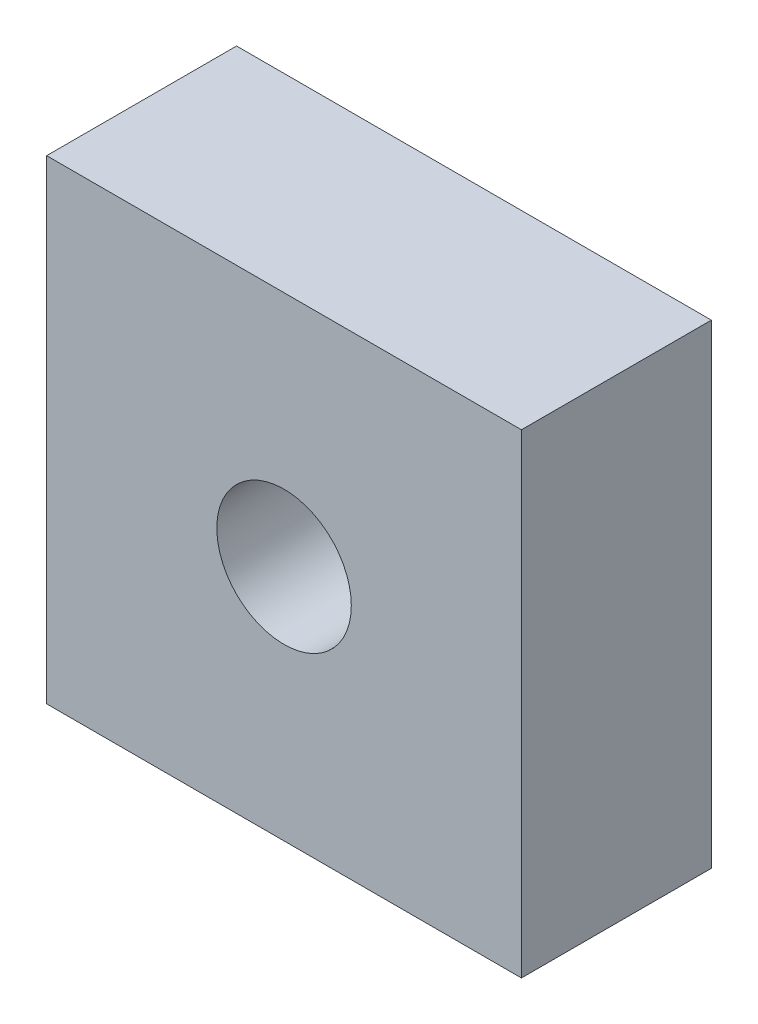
ISO-10303-21;
HEADER;
FILE_DESCRIPTION(('STEP AP214'),'2;1');
FILE_NAME('part.step','',(''),(''),'','','');
FILE_SCHEMA(('AUTOMOTIVE_DESIGN { 1 0 10303 214 1 1 1 1 }'));
ENDSEC;
DATA;
#1=APPLICATION_CONTEXT('core data for automotive mechanical design processes');
#2=APPLICATION_PROTOCOL_DEFINITION('international standard','automotive_design',2000,#1);
#3=PRODUCT_CONTEXT('',#1,'mechanical');
#4=PRODUCT('Part','Part','',(#3));
#5=PRODUCT_RELATED_PRODUCT_CATEGORY('part','',(#4));
#6=PRODUCT_DEFINITION_FORMATION('','',#4);
#7=PRODUCT_DEFINITION_CONTEXT('part definition',#1,'design');
#8=PRODUCT_DEFINITION('design','',#6,#7);
#9=PRODUCT_DEFINITION_SHAPE('','',#8);
#10=(LENGTH_UNIT() NAMED_UNIT(*) SI_UNIT(.MILLI.,.METRE.));
#11=(NAMED_UNIT(*) PLANE_ANGLE_UNIT() SI_UNIT($,.RADIAN.));
#12=(NAMED_UNIT(*) SI_UNIT($,.STERADIAN.) SOLID_ANGLE_UNIT());
#13=UNCERTAINTY_MEASURE_WITH_UNIT(LENGTH_MEASURE(1.E-05),#10,'distance_accuracy_value','');
#14=(GEOMETRIC_REPRESENTATION_CONTEXT(3) GLOBAL_UNCERTAINTY_ASSIGNED_CONTEXT((#13)) GLOBAL_UNIT_ASSIGNED_CONTEXT((#10,
#11,#12)) REPRESENTATION_CONTEXT('',''));
#15=CARTESIAN_POINT('',(0.,0.,0.));
#16=DIRECTION('',(0.,0.,1.));
#17=DIRECTION('',(1.,0.,0.));
#18=AXIS2_PLACEMENT_3D('',#15,#16,#17);
#19=CARTESIAN_POINT('',(0.,-30.,12.));
#20=DIRECTION('',(0.,0.,1.));
#21=DIRECTION('',(1.,0.,0.));
#22=AXIS2_PLACEMENT_3D('',#19,#20,#21);
#23=PLANE('',#22);
#24=DIRECTION('',(0.,-1.,0.));
#25=VECTOR('',#24,1.);
#26=CARTESIAN_POINT('',(0.,0.,12.));
#27=LINE('',#26,#25);
#28=CARTESIAN_POINT('',(0.,0.,12.));
#29=VERTEX_POINT('',#28);
#30=CARTESIAN_POINT('',(0.,-30.,12.));
#31=VERTEX_POINT('',#30);
#32=EDGE_CURVE('E98',#29,#31,#27,.T.);
#33=ORIENTED_EDGE('',*,*,#32,.T.);
#34=DIRECTION('',(1.,0.,0.));
#35=VECTOR('',#34,1.);
#36=CARTESIAN_POINT('',(0.,-30.,12.));
#37=LINE('',#36,#35);
#38=CARTESIAN_POINT('',(30.,-30.,12.));
#39=VERTEX_POINT('',#38);
#40=EDGE_CURVE('E83',#31,#39,#37,.T.);
#41=ORIENTED_EDGE('',*,*,#40,.T.);
#42=DIRECTION('',(0.,1.,0.));
#43=VECTOR('',#42,1.);
#44=CARTESIAN_POINT('',(30.,0.,12.));
#45=LINE('',#44,#43);
#46=CARTESIAN_POINT('',(30.,0.,12.));
#47=VERTEX_POINT('',#46);
#48=EDGE_CURVE('E49',#39,#47,#45,.T.);
#49=ORIENTED_EDGE('',*,*,#48,.T.);
#50=DIRECTION('',(-1.,0.,0.));
#51=VECTOR('',#50,1.);
#52=CARTESIAN_POINT('',(0.,0.,12.));
#53=LINE('',#52,#51);
#54=EDGE_CURVE('E44',#47,#29,#53,.T.);
#55=ORIENTED_EDGE('',*,*,#54,.T.);
#56=EDGE_LOOP('',(#33,#41,#49,#55));
#57=FACE_BOUND('',#56,.T.);
#58=CARTESIAN_POINT('',(15.,-15.,12.));
#59=DIRECTION('',(0.,0.,1.));
#60=DIRECTION('',(1.,0.,0.));
#61=AXIS2_PLACEMENT_3D('',#58,#59,#60);
#62=CIRCLE('',#61,4.25);
#63=CARTESIAN_POINT('',(19.25,-15.,12.));
#64=VERTEX_POINT('',#63);
#65=EDGE_CURVE('E88',#64,#64,#62,.T.);
#66=ORIENTED_EDGE('',*,*,#65,.F.);
#67=EDGE_LOOP('',(#66));
#68=FACE_BOUND('',#67,.T.);
#69=ADVANCED_FACE('F29',(#57,#68),#23,.T.);
#70=CARTESIAN_POINT('',(0.,-30.,0.));
#71=DIRECTION('',(0.,0.,1.));
#72=DIRECTION('',(1.,0.,0.));
#73=AXIS2_PLACEMENT_3D('',#70,#71,#72);
#74=PLANE('',#73);
#75=DIRECTION('',(0.,-1.,0.));
#76=VECTOR('',#75,1.);
#77=CARTESIAN_POINT('',(0.,0.,0.));
#78=LINE('',#77,#76);
#79=CARTESIAN_POINT('',(0.,0.,0.));
#80=VERTEX_POINT('',#79);
#81=CARTESIAN_POINT('',(0.,-30.,0.));
#82=VERTEX_POINT('',#81);
#83=EDGE_CURVE('E75',#80,#82,#78,.T.);
#84=ORIENTED_EDGE('',*,*,#83,.F.);
#85=DIRECTION('',(-1.,0.,0.));
#86=VECTOR('',#85,1.);
#87=CARTESIAN_POINT('',(0.,0.,0.));
#88=LINE('',#87,#86);
#89=CARTESIAN_POINT('',(30.,0.,0.));
#90=VERTEX_POINT('',#89);
#91=EDGE_CURVE('E96',#90,#80,#88,.T.);
#92=ORIENTED_EDGE('',*,*,#91,.F.);
#93=DIRECTION('',(0.,1.,0.));
#94=VECTOR('',#93,1.);
#95=CARTESIAN_POINT('',(30.,0.,0.));
#96=LINE('',#95,#94);
#97=CARTESIAN_POINT('',(30.,-30.,0.));
#98=VERTEX_POINT('',#97);
#99=EDGE_CURVE('E76',#98,#90,#96,.T.);
#100=ORIENTED_EDGE('',*,*,#99,.F.);
#101=DIRECTION('',(1.,0.,0.));
#102=VECTOR('',#101,1.);
#103=CARTESIAN_POINT('',(0.,-30.,0.));
#104=LINE('',#103,#102);
#105=EDGE_CURVE('E70',#82,#98,#104,.T.);
#106=ORIENTED_EDGE('',*,*,#105,.F.);
#107=EDGE_LOOP('',(#84,#92,#100,#106));
#108=FACE_BOUND('',#107,.T.);
#109=CARTESIAN_POINT('',(15.,-15.,0.));
#110=DIRECTION('',(0.,0.,1.));
#111=DIRECTION('',(1.,0.,0.));
#112=AXIS2_PLACEMENT_3D('',#109,#110,#111);
#113=CIRCLE('',#112,4.25);
#114=CARTESIAN_POINT('',(19.25,-15.,0.));
#115=VERTEX_POINT('',#114);
#116=EDGE_CURVE('E91',#115,#115,#113,.T.);
#117=ORIENTED_EDGE('',*,*,#116,.T.);
#118=EDGE_LOOP('',(#117));
#119=FACE_BOUND('',#118,.T.);
#120=ADVANCED_FACE('F71',(#108,#119),#74,.F.);
#121=CARTESIAN_POINT('',(0.,0.,12.));
#122=DIRECTION('',(1.,0.,0.));
#123=DIRECTION('',(0.,1.,0.));
#124=AXIS2_PLACEMENT_3D('',#121,#122,#123);
#125=PLANE('',#124);
#126=ORIENTED_EDGE('',*,*,#83,.T.);
#127=DIRECTION('',(0.,0.,-1.));
#128=VECTOR('',#127,1.);
#129=CARTESIAN_POINT('',(0.,-30.,12.));
#130=LINE('',#129,#128);
#131=EDGE_CURVE('E11',#31,#82,#130,.T.);
#132=ORIENTED_EDGE('',*,*,#131,.F.);
#133=ORIENTED_EDGE('',*,*,#32,.F.);
#134=DIRECTION('',(0.,0.,-1.));
#135=VECTOR('',#134,1.);
#136=CARTESIAN_POINT('',(0.,0.,12.));
#137=LINE('',#136,#135);
#138=EDGE_CURVE('E87',#29,#80,#137,.T.);
#139=ORIENTED_EDGE('',*,*,#138,.T.);
#140=EDGE_LOOP('',(#126,#132,#133,#139));
#141=FACE_BOUND('',#140,.T.);
#142=ADVANCED_FACE('F31',(#141),#125,.F.);
#143=CARTESIAN_POINT('',(0.,-30.,12.));
#144=DIRECTION('',(0.,1.,0.));
#145=DIRECTION('',(0.,0.,1.));
#146=AXIS2_PLACEMENT_3D('',#143,#144,#145);
#147=PLANE('',#146);
#148=ORIENTED_EDGE('',*,*,#105,.T.);
#149=DIRECTION('',(0.,0.,-1.));
#150=VECTOR('',#149,1.);
#151=CARTESIAN_POINT('',(30.,-30.,12.));
#152=LINE('',#151,#150);
#153=EDGE_CURVE('E37',#39,#98,#152,.T.);
#154=ORIENTED_EDGE('',*,*,#153,.F.);
#155=ORIENTED_EDGE('',*,*,#40,.F.);
#156=ORIENTED_EDGE('',*,*,#131,.T.);
#157=EDGE_LOOP('',(#148,#154,#155,#156));
#158=FACE_BOUND('',#157,.T.);
#159=ADVANCED_FACE('F82',(#158),#147,.F.);
#160=CARTESIAN_POINT('',(30.,0.,12.));
#161=DIRECTION('',(-1.,0.,0.));
#162=DIRECTION('',(0.,-1.,0.));
#163=AXIS2_PLACEMENT_3D('',#160,#161,#162);
#164=PLANE('',#163);
#165=ORIENTED_EDGE('',*,*,#99,.T.);
#166=DIRECTION('',(0.,0.,-1.));
#167=VECTOR('',#166,1.);
#168=CARTESIAN_POINT('',(30.,0.,12.));
#169=LINE('',#168,#167);
#170=EDGE_CURVE('E104',#47,#90,#169,.T.);
#171=ORIENTED_EDGE('',*,*,#170,.F.);
#172=ORIENTED_EDGE('',*,*,#48,.F.);
#173=ORIENTED_EDGE('',*,*,#153,.T.);
#174=EDGE_LOOP('',(#165,#171,#172,#173));
#175=FACE_BOUND('',#174,.T.);
#176=ADVANCED_FACE('F107',(#175),#164,.F.);
#177=CARTESIAN_POINT('',(0.,0.,12.));
#178=DIRECTION('',(0.,-1.,0.));
#179=DIRECTION('',(0.,0.,-1.));
#180=AXIS2_PLACEMENT_3D('',#177,#178,#179);
#181=PLANE('',#180);
#182=ORIENTED_EDGE('',*,*,#91,.T.);
#183=ORIENTED_EDGE('',*,*,#138,.F.);
#184=ORIENTED_EDGE('',*,*,#54,.F.);
#185=ORIENTED_EDGE('',*,*,#170,.T.);
#186=EDGE_LOOP('',(#182,#183,#184,#185));
#187=FACE_BOUND('',#186,.T.);
#188=ADVANCED_FACE('F109',(#187),#181,.F.);
#189=CARTESIAN_POINT('',(15.,-15.,12.));
#190=DIRECTION('',(0.,0.,-1.));
#191=DIRECTION('',(-1.,0.,0.));
#192=AXIS2_PLACEMENT_3D('',#189,#190,#191);
#193=CYLINDRICAL_SURFACE('',#192,4.25);
#194=ORIENTED_EDGE('',*,*,#65,.T.);
#195=EDGE_LOOP('',(#194));
#196=FACE_BOUND('',#195,.T.);
#197=ORIENTED_EDGE('',*,*,#116,.F.);
#198=EDGE_LOOP('',(#197));
#199=FACE_BOUND('',#198,.T.);
#200=ADVANCED_FACE('F115',(#196,#199),#193,.F.);
#201=CLOSED_SHELL('',(#69,#120,#142,#159,#176,#188,#200));
#202=MANIFOLD_SOLID_BREP('B2',#201);
#203=ADVANCED_BREP_SHAPE_REPRESENTATION('',(#18,#202),#14);
#204=SHAPE_DEFINITION_REPRESENTATION(#9,#203);
ENDSEC;
END-ISO-10303-21;
